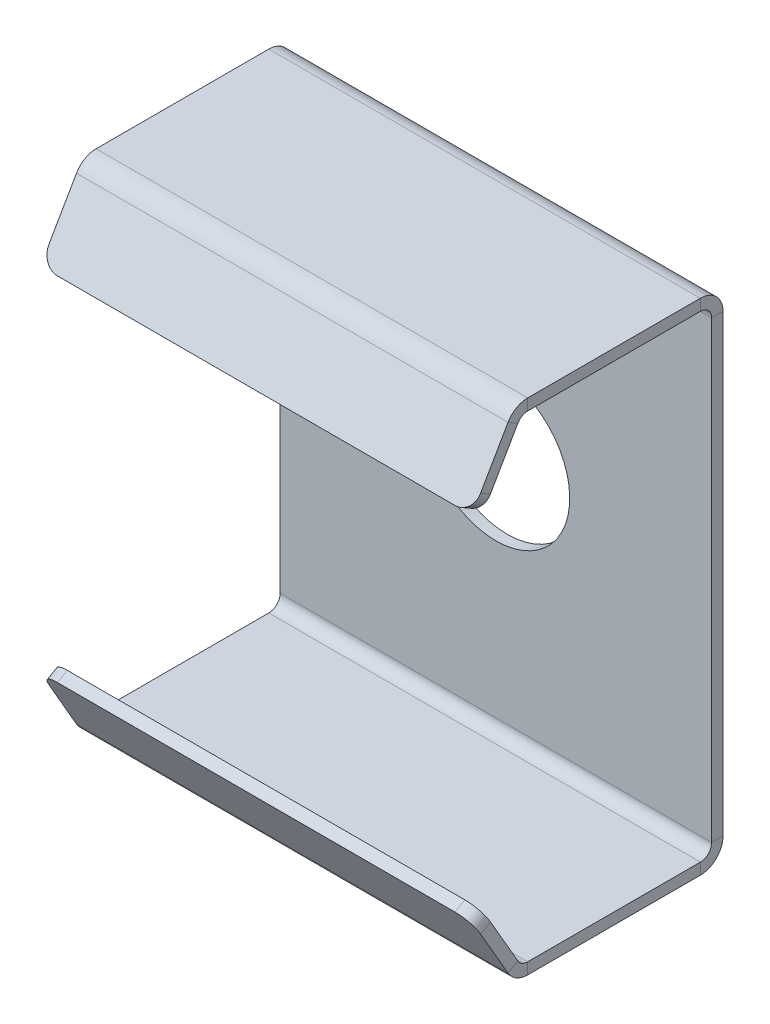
ISO-10303-21;
HEADER;
FILE_DESCRIPTION(('STEP AP214'),'2;1');
FILE_NAME('part.step','',(''),(''),'','','');
FILE_SCHEMA(('AUTOMOTIVE_DESIGN { 1 0 10303 214 1 1 1 1 }'));
ENDSEC;
DATA;
#1=APPLICATION_CONTEXT('core data for automotive mechanical design processes');
#2=APPLICATION_PROTOCOL_DEFINITION('international standard','automotive_design',2000,#1);
#3=PRODUCT_CONTEXT('',#1,'mechanical');
#4=PRODUCT('Part','Part','',(#3));
#5=PRODUCT_RELATED_PRODUCT_CATEGORY('part','',(#4));
#6=PRODUCT_DEFINITION_FORMATION('','',#4);
#7=PRODUCT_DEFINITION_CONTEXT('part definition',#1,'design');
#8=PRODUCT_DEFINITION('design','',#6,#7);
#9=PRODUCT_DEFINITION_SHAPE('','',#8);
#10=(LENGTH_UNIT() NAMED_UNIT(*) SI_UNIT(.MILLI.,.METRE.));
#11=(NAMED_UNIT(*) PLANE_ANGLE_UNIT() SI_UNIT($,.RADIAN.));
#12=(NAMED_UNIT(*) SI_UNIT($,.STERADIAN.) SOLID_ANGLE_UNIT());
#13=UNCERTAINTY_MEASURE_WITH_UNIT(LENGTH_MEASURE(1.E-05),#10,'distance_accuracy_value','');
#14=(GEOMETRIC_REPRESENTATION_CONTEXT(3) GLOBAL_UNCERTAINTY_ASSIGNED_CONTEXT((#13)) GLOBAL_UNIT_ASSIGNED_CONTEXT((#10,
#11,#12)) REPRESENTATION_CONTEXT('',''));
#15=CARTESIAN_POINT('',(0.,0.,0.));
#16=DIRECTION('',(0.,0.,1.));
#17=DIRECTION('',(1.,0.,0.));
#18=AXIS2_PLACEMENT_3D('',#15,#16,#17);
#19=CARTESIAN_POINT('',(17.5,-16.3038475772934,20.4886751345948));
#20=DIRECTION('',(0.,-0.5,0.866025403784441));
#21=DIRECTION('',(0.707106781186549,0.612372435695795,0.35355339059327));
#22=AXIS2_PLACEMENT_3D('',#19,#20,#21);
#23=CYLINDRICAL_SURFACE('',#22,1.5);
#24=CARTESIAN_POINT('',(17.5,-16.8038475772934,21.3547005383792));
#25=DIRECTION('',(0.,0.5,-0.86602540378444));
#26=DIRECTION('',(0.707106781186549,0.612372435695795,0.35355339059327));
#27=AXIS2_PLACEMENT_3D('',#24,#25,#26);
#28=CIRCLE('',#27,1.5);
#29=CARTESIAN_POINT('',(17.5,-15.5048094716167,22.1047005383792));
#30=VERTEX_POINT('',#29);
#31=CARTESIAN_POINT('',(19.,-16.8038475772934,21.3547005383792));
#32=VERTEX_POINT('',#31);
#33=EDGE_CURVE('E9',#30,#32,#28,.T.);
#34=ORIENTED_EDGE('',*,*,#33,.T.);
#35=DIRECTION('',(0.,0.5,-0.866025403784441));
#36=VECTOR('',#35,1.);
#37=CARTESIAN_POINT('',(19.,-16.3038475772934,20.4886751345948));
#38=LINE('',#37,#36);
#39=CARTESIAN_POINT('',(19.,-16.3038475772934,20.4886751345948));
#40=VERTEX_POINT('',#39);
#41=EDGE_CURVE('E25',#32,#40,#38,.T.);
#42=ORIENTED_EDGE('',*,*,#41,.T.);
#43=CARTESIAN_POINT('',(17.5,-16.3038475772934,20.4886751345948));
#44=DIRECTION('',(0.,-0.5,0.86602540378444));
#45=DIRECTION('',(0.707106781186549,0.612372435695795,0.35355339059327));
#46=AXIS2_PLACEMENT_3D('',#43,#44,#45);
#47=CIRCLE('',#46,1.5);
#48=CARTESIAN_POINT('',(17.5,-15.0048094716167,21.2386751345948));
#49=VERTEX_POINT('',#48);
#50=EDGE_CURVE('E280',#40,#49,#47,.T.);
#51=ORIENTED_EDGE('',*,*,#50,.T.);
#52=DIRECTION('',(0.,-0.5,0.866025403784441));
#53=VECTOR('',#52,1.);
#54=CARTESIAN_POINT('',(17.5,-15.0048094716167,21.2386751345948));
#55=LINE('',#54,#53);
#56=EDGE_CURVE('E18',#49,#30,#55,.T.);
#57=ORIENTED_EDGE('',*,*,#56,.T.);
#58=EDGE_LOOP('',(#34,#42,#51,#57));
#59=FACE_BOUND('',#58,.T.);
#60=ADVANCED_FACE('F14',(#59),#23,.T.);
#61=CARTESIAN_POINT('',(-19.,-15.0048094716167,21.2386751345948));
#62=DIRECTION('',(0.,0.866025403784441,0.5));
#63=DIRECTION('',(1.,0.,0.));
#64=AXIS2_PLACEMENT_3D('',#61,#62,#63);
#65=PLANE('',#64);
#66=ORIENTED_EDGE('',*,*,#56,.F.);
#67=DIRECTION('',(1.,0.,0.));
#68=VECTOR('',#67,1.);
#69=CARTESIAN_POINT('',(-19.,-15.0048094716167,21.2386751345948));
#70=LINE('',#69,#68);
#71=CARTESIAN_POINT('',(-17.5,-15.0048094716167,21.2386751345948));
#72=VERTEX_POINT('',#71);
#73=EDGE_CURVE('E428',#72,#49,#70,.T.);
#74=ORIENTED_EDGE('',*,*,#73,.F.);
#75=DIRECTION('',(0.,0.5,-0.866025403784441));
#76=VECTOR('',#75,1.);
#77=CARTESIAN_POINT('',(-17.5,-15.0048094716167,21.2386751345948));
#78=LINE('',#77,#76);
#79=CARTESIAN_POINT('',(-17.5,-15.5048094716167,22.1047005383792));
#80=VERTEX_POINT('',#79);
#81=EDGE_CURVE('E267',#80,#72,#78,.T.);
#82=ORIENTED_EDGE('',*,*,#81,.F.);
#83=DIRECTION('',(1.,0.,0.));
#84=VECTOR('',#83,1.);
#85=CARTESIAN_POINT('',(-19.,-15.5048094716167,22.1047005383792));
#86=LINE('',#85,#84);
#87=EDGE_CURVE('E388',#80,#30,#86,.T.);
#88=ORIENTED_EDGE('',*,*,#87,.T.);
#89=EDGE_LOOP('',(#66,#74,#82,#88));
#90=FACE_BOUND('',#89,.T.);
#91=ADVANCED_FACE('F709',(#90),#65,.T.);
#92=CARTESIAN_POINT('',(0.,-18.4053725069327,19.2753591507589));
#93=DIRECTION('',(0.,-0.5,0.86602540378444));
#94=DIRECTION('',(-1.,0.,0.));
#95=AXIS2_PLACEMENT_3D('',#92,#93,#94);
#96=PLANE('',#95);
#97=ORIENTED_EDGE('',*,*,#50,.F.);
#98=DIRECTION('',(0.,-0.866025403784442,-0.499999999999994));
#99=VECTOR('',#98,1.);
#100=CARTESIAN_POINT('',(19.,-24.4178066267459,15.8040786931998));
#101=LINE('',#100,#99);
#102=CARTESIAN_POINT('',(19.,-20.5,18.0660254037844));
#103=VERTEX_POINT('',#102);
#104=EDGE_CURVE('E232',#40,#103,#101,.T.);
#105=ORIENTED_EDGE('',*,*,#104,.T.);
#106=DIRECTION('',(-1.,0.,0.));
#107=VECTOR('',#106,1.);
#108=CARTESIAN_POINT('',(0.,-20.5,18.0660254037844));
#109=LINE('',#108,#107);
#110=CARTESIAN_POINT('',(-19.,-20.5,18.0660254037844));
#111=VERTEX_POINT('',#110);
#112=EDGE_CURVE('E424',#103,#111,#109,.T.);
#113=ORIENTED_EDGE('',*,*,#112,.T.);
#114=DIRECTION('',(0.,-0.866025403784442,-0.499999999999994));
#115=VECTOR('',#114,1.);
#116=CARTESIAN_POINT('',(-19.,-24.4178066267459,15.8040786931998));
#117=LINE('',#116,#115);
#118=CARTESIAN_POINT('',(-19.,-16.3038475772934,20.4886751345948));
#119=VERTEX_POINT('',#118);
#120=EDGE_CURVE('E582',#119,#111,#117,.T.);
#121=ORIENTED_EDGE('',*,*,#120,.F.);
#122=CARTESIAN_POINT('',(-17.5,-16.3038475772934,20.4886751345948));
#123=DIRECTION('',(0.,-0.5,0.866025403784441));
#124=DIRECTION('',(-0.707106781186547,0.612372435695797,0.35355339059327));
#125=AXIS2_PLACEMENT_3D('',#122,#123,#124);
#126=CIRCLE('',#125,1.5);
#127=EDGE_CURVE('E263',#72,#119,#126,.T.);
#128=ORIENTED_EDGE('',*,*,#127,.F.);
#129=ORIENTED_EDGE('',*,*,#73,.T.);
#130=EDGE_LOOP('',(#97,#105,#113,#121,#128,#129));
#131=FACE_BOUND('',#130,.T.);
#132=ADVANCED_FACE('F493',(#131),#96,.F.);
#133=CARTESIAN_POINT('',(-17.5,-16.3038475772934,20.4886751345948));
#134=DIRECTION('',(0.,-0.5,0.866025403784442));
#135=DIRECTION('',(-0.707106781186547,0.612372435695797,0.35355339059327));
#136=AXIS2_PLACEMENT_3D('',#133,#134,#135);
#137=CYLINDRICAL_SURFACE('',#136,1.5);
#138=CARTESIAN_POINT('',(-17.5,-16.8038475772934,21.3547005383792));
#139=DIRECTION('',(0.,0.5,-0.866025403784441));
#140=DIRECTION('',(-0.707106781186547,0.612372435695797,0.35355339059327));
#141=AXIS2_PLACEMENT_3D('',#138,#139,#140);
#142=CIRCLE('',#141,1.5);
#143=CARTESIAN_POINT('',(-19.,-16.8038475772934,21.3547005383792));
#144=VERTEX_POINT('',#143);
#145=EDGE_CURVE('E477',#144,#80,#142,.T.);
#146=ORIENTED_EDGE('',*,*,#145,.T.);
#147=ORIENTED_EDGE('',*,*,#81,.T.);
#148=ORIENTED_EDGE('',*,*,#127,.T.);
#149=DIRECTION('',(0.,-0.5,0.866025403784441));
#150=VECTOR('',#149,1.);
#151=CARTESIAN_POINT('',(-19.,-16.3038475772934,20.4886751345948));
#152=LINE('',#151,#150);
#153=EDGE_CURVE('E268',#119,#144,#152,.T.);
#154=ORIENTED_EDGE('',*,*,#153,.T.);
#155=EDGE_LOOP('',(#146,#147,#148,#154));
#156=FACE_BOUND('',#155,.T.);
#157=ADVANCED_FACE('F685',(#156),#137,.T.);
#158=CARTESIAN_POINT('',(-19.,-20.5,18.0660254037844));
#159=DIRECTION('',(-1.,0.,0.));
#160=DIRECTION('',(0.,1.,0.));
#161=AXIS2_PLACEMENT_3D('',#158,#159,#160);
#162=PLANE('',#161);
#163=ORIENTED_EDGE('',*,*,#153,.F.);
#164=ORIENTED_EDGE('',*,*,#120,.T.);
#165=DIRECTION('',(0.,-0.5,0.86602540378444));
#166=VECTOR('',#165,1.);
#167=CARTESIAN_POINT('',(-19.,-20.61,18.256550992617));
#168=LINE('',#167,#166);
#169=CARTESIAN_POINT('',(-19.,-21.,18.9320508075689));
#170=VERTEX_POINT('',#169);
#171=EDGE_CURVE('E463',#111,#170,#168,.T.);
#172=ORIENTED_EDGE('',*,*,#171,.T.);
#173=DIRECTION('',(0.,0.86602540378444,0.5));
#174=VECTOR('',#173,1.);
#175=CARTESIAN_POINT('',(-19.,-21.,18.9320508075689));
#176=LINE('',#175,#174);
#177=EDGE_CURVE('E192',#170,#144,#176,.T.);
#178=ORIENTED_EDGE('',*,*,#177,.T.);
#179=EDGE_LOOP('',(#163,#164,#172,#178));
#180=FACE_BOUND('',#179,.T.);
#181=ADVANCED_FACE('F690',(#180),#162,.T.);
#182=CARTESIAN_POINT('',(17.5,16.3038475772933,20.4886751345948));
#183=DIRECTION('',(0.,0.5,0.866025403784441));
#184=DIRECTION('',(0.707106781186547,-0.612372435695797,0.35355339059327));
#185=AXIS2_PLACEMENT_3D('',#182,#183,#184);
#186=CYLINDRICAL_SURFACE('',#185,1.5);
#187=CARTESIAN_POINT('',(17.5,16.8038475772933,21.3547005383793));
#188=DIRECTION('',(0.,-0.5,-0.866025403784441));
#189=DIRECTION('',(0.707106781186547,-0.612372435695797,0.35355339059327));
#190=AXIS2_PLACEMENT_3D('',#187,#188,#189);
#191=CIRCLE('',#190,1.5);
#192=CARTESIAN_POINT('',(19.,16.8038475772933,21.3547005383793));
#193=VERTEX_POINT('',#192);
#194=CARTESIAN_POINT('',(17.5,15.5048094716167,22.1047005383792));
#195=VERTEX_POINT('',#194);
#196=EDGE_CURVE('E392',#193,#195,#191,.T.);
#197=ORIENTED_EDGE('',*,*,#196,.T.);
#198=DIRECTION('',(0.,-0.5,-0.86602540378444));
#199=VECTOR('',#198,1.);
#200=CARTESIAN_POINT('',(17.5,15.0048094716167,21.2386751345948));
#201=LINE('',#200,#199);
#202=CARTESIAN_POINT('',(17.5,15.0048094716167,21.2386751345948));
#203=VERTEX_POINT('',#202);
#204=EDGE_CURVE('E395',#195,#203,#201,.T.);
#205=ORIENTED_EDGE('',*,*,#204,.T.);
#206=CARTESIAN_POINT('',(17.5,16.3038475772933,20.4886751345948));
#207=DIRECTION('',(0.,0.5,0.866025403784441));
#208=DIRECTION('',(0.707106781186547,-0.612372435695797,0.35355339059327));
#209=AXIS2_PLACEMENT_3D('',#206,#207,#208);
#210=CIRCLE('',#209,1.5);
#211=CARTESIAN_POINT('',(19.,16.3038475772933,20.4886751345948));
#212=VERTEX_POINT('',#211);
#213=EDGE_CURVE('E446',#203,#212,#210,.T.);
#214=ORIENTED_EDGE('',*,*,#213,.T.);
#215=DIRECTION('',(0.,0.5,0.86602540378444));
#216=VECTOR('',#215,1.);
#217=CARTESIAN_POINT('',(19.,16.3038475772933,20.4886751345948));
#218=LINE('',#217,#216);
#219=EDGE_CURVE('E77',#212,#193,#218,.T.);
#220=ORIENTED_EDGE('',*,*,#219,.T.);
#221=EDGE_LOOP('',(#197,#205,#214,#220));
#222=FACE_BOUND('',#221,.T.);
#223=ADVANCED_FACE('F777',(#222),#186,.T.);
#224=CARTESIAN_POINT('',(19.,20.5,18.0660254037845));
#225=DIRECTION('',(1.,0.,0.));
#226=DIRECTION('',(0.,-1.,0.));
#227=AXIS2_PLACEMENT_3D('',#224,#225,#226);
#228=PLANE('',#227);
#229=ORIENTED_EDGE('',*,*,#219,.F.);
#230=DIRECTION('',(0.,0.866025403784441,-0.5));
#231=VECTOR('',#230,1.);
#232=CARTESIAN_POINT('',(19.,24.4178066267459,15.8040786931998));
#233=LINE('',#232,#231);
#234=CARTESIAN_POINT('',(19.,20.5,18.0660254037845));
#235=VERTEX_POINT('',#234);
#236=EDGE_CURVE('E309',#212,#235,#233,.T.);
#237=ORIENTED_EDGE('',*,*,#236,.T.);
#238=DIRECTION('',(0.,0.5,0.866025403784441));
#239=VECTOR('',#238,1.);
#240=CARTESIAN_POINT('',(19.,20.61,18.256550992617));
#241=LINE('',#240,#239);
#242=CARTESIAN_POINT('',(19.,21.,18.9320508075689));
#243=VERTEX_POINT('',#242);
#244=EDGE_CURVE('E312',#235,#243,#241,.T.);
#245=ORIENTED_EDGE('',*,*,#244,.T.);
#246=DIRECTION('',(0.,-0.866025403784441,0.5));
#247=VECTOR('',#246,1.);
#248=CARTESIAN_POINT('',(19.,21.,18.9320508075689));
#249=LINE('',#248,#247);
#250=EDGE_CURVE('E358',#243,#193,#249,.T.);
#251=ORIENTED_EDGE('',*,*,#250,.T.);
#252=EDGE_LOOP('',(#229,#237,#245,#251));
#253=FACE_BOUND('',#252,.T.);
#254=ADVANCED_FACE('F753',(#253),#228,.T.);
#255=CARTESIAN_POINT('',(0.,18.4053725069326,19.2753591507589));
#256=DIRECTION('',(0.,-0.5,-0.866025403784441));
#257=DIRECTION('',(-1.,0.,0.));
#258=AXIS2_PLACEMENT_3D('',#255,#256,#257);
#259=PLANE('',#258);
#260=ORIENTED_EDGE('',*,*,#213,.F.);
#261=DIRECTION('',(-1.,0.,0.));
#262=VECTOR('',#261,1.);
#263=CARTESIAN_POINT('',(19.,15.0048094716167,21.2386751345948));
#264=LINE('',#263,#262);
#265=CARTESIAN_POINT('',(-17.5,15.0048094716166,21.2386751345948));
#266=VERTEX_POINT('',#265);
#267=EDGE_CURVE('E371',#203,#266,#264,.T.);
#268=ORIENTED_EDGE('',*,*,#267,.T.);
#269=CARTESIAN_POINT('',(-17.5,16.3038475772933,20.4886751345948));
#270=DIRECTION('',(0.,0.5,0.866025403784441));
#271=DIRECTION('',(-0.707106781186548,-0.612372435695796,0.353553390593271));
#272=AXIS2_PLACEMENT_3D('',#269,#270,#271);
#273=CIRCLE('',#272,1.5);
#274=CARTESIAN_POINT('',(-19.,16.3038475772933,20.4886751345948));
#275=VERTEX_POINT('',#274);
#276=EDGE_CURVE('E313',#275,#266,#273,.T.);
#277=ORIENTED_EDGE('',*,*,#276,.F.);
#278=DIRECTION('',(0.,0.866025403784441,-0.5));
#279=VECTOR('',#278,1.);
#280=CARTESIAN_POINT('',(-19.,24.4178066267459,15.8040786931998));
#281=LINE('',#280,#279);
#282=CARTESIAN_POINT('',(-19.,20.5,18.0660254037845));
#283=VERTEX_POINT('',#282);
#284=EDGE_CURVE('E326',#275,#283,#281,.T.);
#285=ORIENTED_EDGE('',*,*,#284,.T.);
#286=DIRECTION('',(1.,0.,0.));
#287=VECTOR('',#286,1.);
#288=CARTESIAN_POINT('',(0.,20.5,18.0660254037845));
#289=LINE('',#288,#287);
#290=EDGE_CURVE('E323',#283,#235,#289,.T.);
#291=ORIENTED_EDGE('',*,*,#290,.T.);
#292=ORIENTED_EDGE('',*,*,#236,.F.);
#293=EDGE_LOOP('',(#260,#268,#277,#285,#291,#292));
#294=FACE_BOUND('',#293,.T.);
#295=ADVANCED_FACE('F573',(#294),#259,.T.);
#296=CARTESIAN_POINT('',(-17.5,16.3038475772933,20.4886751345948));
#297=DIRECTION('',(0.,0.5,0.86602540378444));
#298=DIRECTION('',(-0.707106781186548,-0.612372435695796,0.353553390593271));
#299=AXIS2_PLACEMENT_3D('',#296,#297,#298);
#300=CYLINDRICAL_SURFACE('',#299,1.5);
#301=CARTESIAN_POINT('',(-17.5,16.8038475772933,21.3547005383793));
#302=DIRECTION('',(0.,-0.5,-0.866025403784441));
#303=DIRECTION('',(-0.707106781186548,-0.612372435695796,0.353553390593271));
#304=AXIS2_PLACEMENT_3D('',#301,#302,#303);
#305=CIRCLE('',#304,1.5);
#306=CARTESIAN_POINT('',(-17.5,15.5048094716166,22.1047005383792));
#307=VERTEX_POINT('',#306);
#308=CARTESIAN_POINT('',(-19.,16.8038475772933,21.3547005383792));
#309=VERTEX_POINT('',#308);
#310=EDGE_CURVE('E327',#307,#309,#305,.T.);
#311=ORIENTED_EDGE('',*,*,#310,.T.);
#312=DIRECTION('',(0.,-0.5,-0.86602540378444));
#313=VECTOR('',#312,1.);
#314=CARTESIAN_POINT('',(-19.,16.3038475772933,20.4886751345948));
#315=LINE('',#314,#313);
#316=EDGE_CURVE('E317',#309,#275,#315,.T.);
#317=ORIENTED_EDGE('',*,*,#316,.T.);
#318=ORIENTED_EDGE('',*,*,#276,.T.);
#319=DIRECTION('',(0.,0.5,0.86602540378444));
#320=VECTOR('',#319,1.);
#321=CARTESIAN_POINT('',(-17.5,15.0048094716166,21.2386751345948));
#322=LINE('',#321,#320);
#323=EDGE_CURVE('E318',#266,#307,#322,.T.);
#324=ORIENTED_EDGE('',*,*,#323,.T.);
#325=EDGE_LOOP('',(#311,#317,#318,#324));
#326=FACE_BOUND('',#325,.T.);
#327=ADVANCED_FACE('F575',(#326),#300,.T.);
#328=CARTESIAN_POINT('',(-19.,20.5,18.0660254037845));
#329=DIRECTION('',(-1.,0.,0.));
#330=DIRECTION('',(0.,0.,-1.));
#331=AXIS2_PLACEMENT_3D('',#328,#329,#330);
#332=PLANE('',#331);
#333=ORIENTED_EDGE('',*,*,#316,.F.);
#334=DIRECTION('',(0.,0.866025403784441,-0.5));
#335=VECTOR('',#334,1.);
#336=CARTESIAN_POINT('',(-19.,24.9178066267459,16.6701040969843));
#337=LINE('',#336,#335);
#338=CARTESIAN_POINT('',(-19.,21.,18.9320508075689));
#339=VERTEX_POINT('',#338);
#340=EDGE_CURVE('E247',#309,#339,#337,.T.);
#341=ORIENTED_EDGE('',*,*,#340,.T.);
#342=DIRECTION('',(0.,-0.5,-0.866025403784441));
#343=VECTOR('',#342,1.);
#344=CARTESIAN_POINT('',(-19.,20.61,18.256550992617));
#345=LINE('',#344,#343);
#346=EDGE_CURVE('E244',#339,#283,#345,.T.);
#347=ORIENTED_EDGE('',*,*,#346,.T.);
#348=ORIENTED_EDGE('',*,*,#284,.F.);
#349=EDGE_LOOP('',(#333,#341,#347,#348));
#350=FACE_BOUND('',#349,.T.);
#351=ADVANCED_FACE('F551',(#350),#332,.T.);
#352=CARTESIAN_POINT('',(0.,-20.,17.2));
#353=DIRECTION('',(-1.,0.,0.));
#354=DIRECTION('',(0.,-1.,0.));
#355=AXIS2_PLACEMENT_3D('',#352,#353,#354);
#356=CYLINDRICAL_SURFACE('',#355,2.);
#357=DIRECTION('',(1.,0.,0.));
#358=VECTOR('',#357,1.);
#359=CARTESIAN_POINT('',(0.,-21.,18.9320508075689));
#360=LINE('',#359,#358);
#361=CARTESIAN_POINT('',(19.,-21.,18.9320508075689));
#362=VERTEX_POINT('',#361);
#363=EDGE_CURVE('E185',#170,#362,#360,.T.);
#364=ORIENTED_EDGE('',*,*,#363,.F.);
#365=CARTESIAN_POINT('',(-19.,-20.,17.2));
#366=DIRECTION('',(-1.,0.,0.));
#367=DIRECTION('',(0.,-1.,0.));
#368=AXIS2_PLACEMENT_3D('',#365,#366,#367);
#369=CIRCLE('',#368,2.);
#370=CARTESIAN_POINT('',(-19.,-22.,17.2));
#371=VERTEX_POINT('',#370);
#372=EDGE_CURVE('E210',#371,#170,#369,.T.);
#373=ORIENTED_EDGE('',*,*,#372,.F.);
#374=DIRECTION('',(1.,0.,0.));
#375=VECTOR('',#374,1.);
#376=CARTESIAN_POINT('',(-19.,-22.,17.2));
#377=LINE('',#376,#375);
#378=CARTESIAN_POINT('',(19.,-22.,17.2));
#379=VERTEX_POINT('',#378);
#380=EDGE_CURVE('E204',#371,#379,#377,.T.);
#381=ORIENTED_EDGE('',*,*,#380,.T.);
#382=CARTESIAN_POINT('',(19.,-20.,17.2));
#383=DIRECTION('',(1.,0.,0.));
#384=DIRECTION('',(0.,-0.5,0.866025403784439));
#385=AXIS2_PLACEMENT_3D('',#382,#383,#384);
#386=CIRCLE('',#385,2.);
#387=EDGE_CURVE('E197',#362,#379,#386,.T.);
#388=ORIENTED_EDGE('',*,*,#387,.F.);
#389=EDGE_LOOP('',(#364,#373,#381,#388));
#390=FACE_BOUND('',#389,.T.);
#391=ADVANCED_FACE('F202',(#390),#356,.T.);
#392=CARTESIAN_POINT('',(19.,-20.5,18.0660254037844));
#393=DIRECTION('',(1.,0.,0.));
#394=DIRECTION('',(0.,-1.,0.));
#395=AXIS2_PLACEMENT_3D('',#392,#393,#394);
#396=PLANE('',#395);
#397=ORIENTED_EDGE('',*,*,#41,.F.);
#398=DIRECTION('',(0.,-0.866025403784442,-0.499999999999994));
#399=VECTOR('',#398,1.);
#400=CARTESIAN_POINT('',(19.,-24.9178066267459,16.6701040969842));
#401=LINE('',#400,#399);
#402=EDGE_CURVE('E189',#32,#362,#401,.T.);
#403=ORIENTED_EDGE('',*,*,#402,.T.);
#404=DIRECTION('',(0.,0.5,-0.86602540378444));
#405=VECTOR('',#404,1.);
#406=CARTESIAN_POINT('',(19.,-20.61,18.256550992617));
#407=LINE('',#406,#405);
#408=EDGE_CURVE('E214',#362,#103,#407,.T.);
#409=ORIENTED_EDGE('',*,*,#408,.T.);
#410=ORIENTED_EDGE('',*,*,#104,.F.);
#411=EDGE_LOOP('',(#397,#403,#409,#410));
#412=FACE_BOUND('',#411,.T.);
#413=ADVANCED_FACE('F213',(#412),#396,.T.);
#414=CARTESIAN_POINT('',(-19.,-20.5,18.0660254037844));
#415=DIRECTION('',(-1.,0.,0.));
#416=DIRECTION('',(0.,1.,0.));
#417=AXIS2_PLACEMENT_3D('',#414,#415,#416);
#418=PLANE('',#417);
#419=ORIENTED_EDGE('',*,*,#171,.F.);
#420=CARTESIAN_POINT('',(-19.,-20.,17.2));
#421=DIRECTION('',(1.,0.,0.));
#422=DIRECTION('',(0.,-0.5,0.866025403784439));
#423=AXIS2_PLACEMENT_3D('',#420,#421,#422);
#424=CIRCLE('',#423,0.999999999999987);
#425=CARTESIAN_POINT('',(-19.,-21.,17.2));
#426=VERTEX_POINT('',#425);
#427=EDGE_CURVE('E221',#111,#426,#424,.T.);
#428=ORIENTED_EDGE('',*,*,#427,.T.);
#429=DIRECTION('',(0.,-1.,0.));
#430=VECTOR('',#429,1.);
#431=CARTESIAN_POINT('',(-19.,-21.,17.2));
#432=LINE('',#431,#430);
#433=EDGE_CURVE('E228',#426,#371,#432,.T.);
#434=ORIENTED_EDGE('',*,*,#433,.T.);
#435=ORIENTED_EDGE('',*,*,#372,.T.);
#436=EDGE_LOOP('',(#419,#428,#434,#435));
#437=FACE_BOUND('',#436,.T.);
#438=ADVANCED_FACE('F692',(#437),#418,.T.);
#439=CARTESIAN_POINT('',(19.,-21.,18.9320508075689));
#440=DIRECTION('',(1.,0.,0.));
#441=DIRECTION('',(0.,-1.,0.));
#442=AXIS2_PLACEMENT_3D('',#439,#440,#441);
#443=PLANE('',#442);
#444=ORIENTED_EDGE('',*,*,#408,.F.);
#445=ORIENTED_EDGE('',*,*,#387,.T.);
#446=DIRECTION('',(0.,-1.,0.));
#447=VECTOR('',#446,1.);
#448=CARTESIAN_POINT('',(19.,-21.,17.2));
#449=LINE('',#448,#447);
#450=CARTESIAN_POINT('',(19.,-21.,17.2));
#451=VERTEX_POINT('',#450);
#452=EDGE_CURVE('E234',#451,#379,#449,.T.);
#453=ORIENTED_EDGE('',*,*,#452,.F.);
#454=CARTESIAN_POINT('',(19.,-20.,17.2));
#455=DIRECTION('',(1.,0.,0.));
#456=DIRECTION('',(0.,-0.5,0.866025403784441));
#457=AXIS2_PLACEMENT_3D('',#454,#455,#456);
#458=CIRCLE('',#457,0.999999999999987);
#459=EDGE_CURVE('E198',#103,#451,#458,.T.);
#460=ORIENTED_EDGE('',*,*,#459,.F.);
#461=EDGE_LOOP('',(#444,#445,#453,#460));
#462=FACE_BOUND('',#461,.T.);
#463=ADVANCED_FACE('F16',(#462),#443,.T.);
#464=CARTESIAN_POINT('',(0.,-18.9053725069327,20.1413845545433));
#465=DIRECTION('',(0.,-0.5,0.86602540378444));
#466=DIRECTION('',(-1.,0.,0.));
#467=AXIS2_PLACEMENT_3D('',#464,#465,#466);
#468=PLANE('',#467);
#469=ORIENTED_EDGE('',*,*,#33,.F.);
#470=ORIENTED_EDGE('',*,*,#87,.F.);
#471=ORIENTED_EDGE('',*,*,#145,.F.);
#472=ORIENTED_EDGE('',*,*,#177,.F.);
#473=ORIENTED_EDGE('',*,*,#363,.T.);
#474=ORIENTED_EDGE('',*,*,#402,.F.);
#475=EDGE_LOOP('',(#469,#470,#471,#472,#473,#474));
#476=FACE_BOUND('',#475,.T.);
#477=ADVANCED_FACE('F188',(#476),#468,.T.);
#478=CARTESIAN_POINT('',(0.,-20.,17.2));
#479=DIRECTION('',(-1.,0.,0.));
#480=DIRECTION('',(0.,-1.,0.));
#481=AXIS2_PLACEMENT_3D('',#478,#479,#480);
#482=CYLINDRICAL_SURFACE('',#481,1.);
#483=ORIENTED_EDGE('',*,*,#112,.F.);
#484=ORIENTED_EDGE('',*,*,#459,.T.);
#485=DIRECTION('',(1.,0.,0.));
#486=VECTOR('',#485,1.);
#487=CARTESIAN_POINT('',(-19.,-21.,17.2));
#488=LINE('',#487,#486);
#489=EDGE_CURVE('E413',#426,#451,#488,.T.);
#490=ORIENTED_EDGE('',*,*,#489,.F.);
#491=ORIENTED_EDGE('',*,*,#427,.F.);
#492=EDGE_LOOP('',(#483,#484,#490,#491));
#493=FACE_BOUND('',#492,.T.);
#494=ADVANCED_FACE('F744',(#493),#482,.F.);
#495=CARTESIAN_POINT('',(0.,20.,17.2));
#496=DIRECTION('',(1.,0.,0.));
#497=DIRECTION('',(0.,1.,0.));
#498=AXIS2_PLACEMENT_3D('',#495,#496,#497);
#499=CYLINDRICAL_SURFACE('',#498,2.);
#500=DIRECTION('',(-1.,0.,0.));
#501=VECTOR('',#500,1.);
#502=CARTESIAN_POINT('',(0.,21.,18.9320508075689));
#503=LINE('',#502,#501);
#504=EDGE_CURVE('E274',#243,#339,#503,.T.);
#505=ORIENTED_EDGE('',*,*,#504,.F.);
#506=CARTESIAN_POINT('',(19.,20.,17.2));
#507=DIRECTION('',(1.,0.,0.));
#508=DIRECTION('',(0.,1.,0.));
#509=AXIS2_PLACEMENT_3D('',#506,#507,#508);
#510=CIRCLE('',#509,2.);
#511=CARTESIAN_POINT('',(19.,22.,17.2));
#512=VERTEX_POINT('',#511);
#513=EDGE_CURVE('E367',#512,#243,#510,.T.);
#514=ORIENTED_EDGE('',*,*,#513,.F.);
#515=DIRECTION('',(-1.,0.,0.));
#516=VECTOR('',#515,1.);
#517=CARTESIAN_POINT('',(19.,22.,17.2));
#518=LINE('',#517,#516);
#519=CARTESIAN_POINT('',(-19.,22.,17.2));
#520=VERTEX_POINT('',#519);
#521=EDGE_CURVE('E308',#512,#520,#518,.T.);
#522=ORIENTED_EDGE('',*,*,#521,.T.);
#523=CARTESIAN_POINT('',(-19.,20.,17.2));
#524=DIRECTION('',(-1.,0.,0.));
#525=DIRECTION('',(0.,0.5,0.866025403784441));
#526=AXIS2_PLACEMENT_3D('',#523,#524,#525);
#527=CIRCLE('',#526,2.);
#528=EDGE_CURVE('E273',#339,#520,#527,.T.);
#529=ORIENTED_EDGE('',*,*,#528,.F.);
#530=EDGE_LOOP('',(#505,#514,#522,#529));
#531=FACE_BOUND('',#530,.T.);
#532=ADVANCED_FACE('F555',(#531),#499,.T.);
#533=CARTESIAN_POINT('',(19.,20.5,18.0660254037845));
#534=DIRECTION('',(1.,0.,0.));
#535=DIRECTION('',(0.,-1.,0.));
#536=AXIS2_PLACEMENT_3D('',#533,#534,#535);
#537=PLANE('',#536);
#538=ORIENTED_EDGE('',*,*,#244,.F.);
#539=CARTESIAN_POINT('',(19.,20.,17.2));
#540=DIRECTION('',(-1.,0.,0.));
#541=DIRECTION('',(0.,0.5,0.86602540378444));
#542=AXIS2_PLACEMENT_3D('',#539,#540,#541);
#543=CIRCLE('',#542,1.);
#544=CARTESIAN_POINT('',(19.,21.,17.2));
#545=VERTEX_POINT('',#544);
#546=EDGE_CURVE('E354',#235,#545,#543,.T.);
#547=ORIENTED_EDGE('',*,*,#546,.T.);
#548=DIRECTION('',(0.,1.,0.));
#549=VECTOR('',#548,1.);
#550=CARTESIAN_POINT('',(19.,21.,17.2));
#551=LINE('',#550,#549);
#552=EDGE_CURVE('E363',#545,#512,#551,.T.);
#553=ORIENTED_EDGE('',*,*,#552,.T.);
#554=ORIENTED_EDGE('',*,*,#513,.T.);
#555=EDGE_LOOP('',(#538,#547,#553,#554));
#556=FACE_BOUND('',#555,.T.);
#557=ADVANCED_FACE('F727',(#556),#537,.T.);
#558=CARTESIAN_POINT('',(-19.,21.,18.9320508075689));
#559=DIRECTION('',(-1.,0.,0.));
#560=DIRECTION('',(0.,0.,-1.));
#561=AXIS2_PLACEMENT_3D('',#558,#559,#560);
#562=PLANE('',#561);
#563=ORIENTED_EDGE('',*,*,#346,.F.);
#564=ORIENTED_EDGE('',*,*,#528,.T.);
#565=DIRECTION('',(0.,1.,0.));
#566=VECTOR('',#565,1.);
#567=CARTESIAN_POINT('',(-19.,21.,17.2));
#568=LINE('',#567,#566);
#569=CARTESIAN_POINT('',(-19.,21.,17.2));
#570=VERTEX_POINT('',#569);
#571=EDGE_CURVE('E262',#570,#520,#568,.T.);
#572=ORIENTED_EDGE('',*,*,#571,.F.);
#573=CARTESIAN_POINT('',(-19.,20.,17.2));
#574=DIRECTION('',(-1.,0.,0.));
#575=DIRECTION('',(0.,0.5,0.86602540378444));
#576=AXIS2_PLACEMENT_3D('',#573,#574,#575);
#577=CIRCLE('',#576,1.);
#578=EDGE_CURVE('E362',#283,#570,#577,.T.);
#579=ORIENTED_EDGE('',*,*,#578,.F.);
#580=EDGE_LOOP('',(#563,#564,#572,#579));
#581=FACE_BOUND('',#580,.T.);
#582=ADVANCED_FACE('F547',(#581),#562,.T.);
#583=CARTESIAN_POINT('',(19.,15.0048094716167,21.2386751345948));
#584=DIRECTION('',(0.,-0.86602540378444,0.5));
#585=DIRECTION('',(-1.,0.,0.));
#586=AXIS2_PLACEMENT_3D('',#583,#584,#585);
#587=PLANE('',#586);
#588=ORIENTED_EDGE('',*,*,#204,.F.);
#589=DIRECTION('',(-1.,0.,0.));
#590=VECTOR('',#589,1.);
#591=CARTESIAN_POINT('',(19.,15.5048094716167,22.1047005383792));
#592=LINE('',#591,#590);
#593=EDGE_CURVE('E269',#195,#307,#592,.T.);
#594=ORIENTED_EDGE('',*,*,#593,.T.);
#595=ORIENTED_EDGE('',*,*,#323,.F.);
#596=ORIENTED_EDGE('',*,*,#267,.F.);
#597=EDGE_LOOP('',(#588,#594,#595,#596));
#598=FACE_BOUND('',#597,.T.);
#599=ADVANCED_FACE('F732',(#598),#587,.T.);
#600=CARTESIAN_POINT('',(0.,18.9053725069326,20.1413845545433));
#601=DIRECTION('',(0.,-0.5,-0.866025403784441));
#602=DIRECTION('',(-1.,0.,0.));
#603=AXIS2_PLACEMENT_3D('',#600,#601,#602);
#604=PLANE('',#603);
#605=ORIENTED_EDGE('',*,*,#196,.F.);
#606=ORIENTED_EDGE('',*,*,#250,.F.);
#607=ORIENTED_EDGE('',*,*,#504,.T.);
#608=ORIENTED_EDGE('',*,*,#340,.F.);
#609=ORIENTED_EDGE('',*,*,#310,.F.);
#610=ORIENTED_EDGE('',*,*,#593,.F.);
#611=EDGE_LOOP('',(#605,#606,#607,#608,#609,#610));
#612=FACE_BOUND('',#611,.T.);
#613=ADVANCED_FACE('F542',(#612),#604,.F.);
#614=CARTESIAN_POINT('',(0.,20.,17.2));
#615=DIRECTION('',(1.,0.,0.));
#616=DIRECTION('',(0.,1.,0.));
#617=AXIS2_PLACEMENT_3D('',#614,#615,#616);
#618=CYLINDRICAL_SURFACE('',#617,1.);
#619=ORIENTED_EDGE('',*,*,#290,.F.);
#620=ORIENTED_EDGE('',*,*,#578,.T.);
#621=DIRECTION('',(-1.,0.,0.));
#622=VECTOR('',#621,1.);
#623=CARTESIAN_POINT('',(19.,21.,17.2));
#624=LINE('',#623,#622);
#625=EDGE_CURVE('E287',#545,#570,#624,.T.);
#626=ORIENTED_EDGE('',*,*,#625,.F.);
#627=ORIENTED_EDGE('',*,*,#546,.F.);
#628=EDGE_LOOP('',(#619,#620,#626,#627));
#629=FACE_BOUND('',#628,.T.);
#630=ADVANCED_FACE('F568',(#629),#618,.F.);
#631=CARTESIAN_POINT('',(0.,-20.,2.));
#632=DIRECTION('',(-1.,0.,0.));
#633=DIRECTION('',(0.,0.,-1.));
#634=AXIS2_PLACEMENT_3D('',#631,#632,#633);
#635=CYLINDRICAL_SURFACE('',#634,2.);
#636=DIRECTION('',(1.,0.,0.));
#637=VECTOR('',#636,1.);
#638=CARTESIAN_POINT('',(0.,-22.,2.));
#639=LINE('',#638,#637);
#640=CARTESIAN_POINT('',(-19.,-22.,2.));
#641=VERTEX_POINT('',#640);
#642=CARTESIAN_POINT('',(19.,-22.,2.));
#643=VERTEX_POINT('',#642);
#644=EDGE_CURVE('E322',#641,#643,#639,.T.);
#645=ORIENTED_EDGE('',*,*,#644,.F.);
#646=CARTESIAN_POINT('',(-19.,-20.,2.));
#647=DIRECTION('',(-1.,0.,0.));
#648=DIRECTION('',(0.,0.,-1.));
#649=AXIS2_PLACEMENT_3D('',#646,#647,#648);
#650=CIRCLE('',#649,2.);
#651=CARTESIAN_POINT('',(-19.,-20.,0.));
#652=VERTEX_POINT('',#651);
#653=EDGE_CURVE('E420',#652,#641,#650,.T.);
#654=ORIENTED_EDGE('',*,*,#653,.F.);
#655=DIRECTION('',(1.,0.,0.));
#656=VECTOR('',#655,1.);
#657=CARTESIAN_POINT('',(-19.,-20.,0.));
#658=LINE('',#657,#656);
#659=CARTESIAN_POINT('',(19.,-20.,0.));
#660=VERTEX_POINT('',#659);
#661=EDGE_CURVE('E375',#652,#660,#658,.T.);
#662=ORIENTED_EDGE('',*,*,#661,.T.);
#663=CARTESIAN_POINT('',(19.,-20.,2.));
#664=DIRECTION('',(1.,0.,0.));
#665=DIRECTION('',(0.,-1.,0.));
#666=AXIS2_PLACEMENT_3D('',#663,#664,#665);
#667=CIRCLE('',#666,2.);
#668=EDGE_CURVE('E405',#643,#660,#667,.T.);
#669=ORIENTED_EDGE('',*,*,#668,.F.);
#670=EDGE_LOOP('',(#645,#654,#662,#669));
#671=FACE_BOUND('',#670,.T.);
#672=ADVANCED_FACE('F646',(#671),#635,.T.);
#673=CARTESIAN_POINT('',(19.,-21.,2.));
#674=DIRECTION('',(1.,0.,0.));
#675=DIRECTION('',(0.,-1.,0.));
#676=AXIS2_PLACEMENT_3D('',#673,#674,#675);
#677=PLANE('',#676);
#678=DIRECTION('',(0.,1.,0.));
#679=VECTOR('',#678,1.);
#680=CARTESIAN_POINT('',(19.,-21.22,2.));
#681=LINE('',#680,#679);
#682=CARTESIAN_POINT('',(19.,-21.,2.));
#683=VERTEX_POINT('',#682);
#684=EDGE_CURVE('E236',#643,#683,#681,.T.);
#685=ORIENTED_EDGE('',*,*,#684,.T.);
#686=DIRECTION('',(0.,0.,-1.));
#687=VECTOR('',#686,1.);
#688=CARTESIAN_POINT('',(19.,-21.,-2.52389342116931));
#689=LINE('',#688,#687);
#690=EDGE_CURVE('E410',#451,#683,#689,.T.);
#691=ORIENTED_EDGE('',*,*,#690,.F.);
#692=ORIENTED_EDGE('',*,*,#452,.T.);
#693=DIRECTION('',(0.,0.,-1.));
#694=VECTOR('',#693,1.);
#695=CARTESIAN_POINT('',(19.,-22.,-2.52389342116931));
#696=LINE('',#695,#694);
#697=EDGE_CURVE('E237',#379,#643,#696,.T.);
#698=ORIENTED_EDGE('',*,*,#697,.T.);
#699=EDGE_LOOP('',(#685,#691,#692,#698));
#700=FACE_BOUND('',#699,.T.);
#701=ADVANCED_FACE('F721',(#700),#677,.T.);
#702=CARTESIAN_POINT('',(0.,-21.,8.46902664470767));
#703=DIRECTION('',(0.,1.,0.));
#704=DIRECTION('',(1.,0.,0.));
#705=AXIS2_PLACEMENT_3D('',#702,#703,#704);
#706=PLANE('',#705);
#707=DIRECTION('',(-1.,0.,0.));
#708=VECTOR('',#707,1.);
#709=CARTESIAN_POINT('',(0.,-21.,2.));
#710=LINE('',#709,#708);
#711=CARTESIAN_POINT('',(-19.,-21.,2.));
#712=VERTEX_POINT('',#711);
#713=EDGE_CURVE('E251',#683,#712,#710,.T.);
#714=ORIENTED_EDGE('',*,*,#713,.T.);
#715=DIRECTION('',(0.,0.,-1.));
#716=VECTOR('',#715,1.);
#717=CARTESIAN_POINT('',(-19.,-21.,-2.5238934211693));
#718=LINE('',#717,#716);
#719=EDGE_CURVE('E330',#426,#712,#718,.T.);
#720=ORIENTED_EDGE('',*,*,#719,.F.);
#721=ORIENTED_EDGE('',*,*,#489,.T.);
#722=ORIENTED_EDGE('',*,*,#690,.T.);
#723=EDGE_LOOP('',(#714,#720,#721,#722));
#724=FACE_BOUND('',#723,.T.);
#725=ADVANCED_FACE('F696',(#724),#706,.T.);
#726=CARTESIAN_POINT('',(-19.,-21.,2.));
#727=DIRECTION('',(-1.,0.,0.));
#728=DIRECTION('',(0.,0.,-1.));
#729=AXIS2_PLACEMENT_3D('',#726,#727,#728);
#730=PLANE('',#729);
#731=DIRECTION('',(0.,-1.,0.));
#732=VECTOR('',#731,1.);
#733=CARTESIAN_POINT('',(-19.,-21.22,2.));
#734=LINE('',#733,#732);
#735=EDGE_CURVE('E406',#712,#641,#734,.T.);
#736=ORIENTED_EDGE('',*,*,#735,.F.);
#737=CARTESIAN_POINT('',(-19.,-20.,2.));
#738=DIRECTION('',(1.,0.,0.));
#739=DIRECTION('',(0.,-1.,0.));
#740=AXIS2_PLACEMENT_3D('',#737,#738,#739);
#741=CIRCLE('',#740,1.);
#742=CARTESIAN_POINT('',(-19.,-20.,1.));
#743=VERTEX_POINT('',#742);
#744=EDGE_CURVE('E414',#712,#743,#741,.T.);
#745=ORIENTED_EDGE('',*,*,#744,.T.);
#746=DIRECTION('',(0.,0.,1.));
#747=VECTOR('',#746,1.);
#748=CARTESIAN_POINT('',(-19.,-20.,0.));
#749=LINE('',#748,#747);
#750=EDGE_CURVE('E300',#652,#743,#749,.T.);
#751=ORIENTED_EDGE('',*,*,#750,.F.);
#752=ORIENTED_EDGE('',*,*,#653,.T.);
#753=EDGE_LOOP('',(#736,#745,#751,#752));
#754=FACE_BOUND('',#753,.T.);
#755=ADVANCED_FACE('F651',(#754),#730,.T.);
#756=CARTESIAN_POINT('',(19.,-22.,2.));
#757=DIRECTION('',(1.,0.,0.));
#758=DIRECTION('',(0.,-1.,0.));
#759=AXIS2_PLACEMENT_3D('',#756,#757,#758);
#760=PLANE('',#759);
#761=ORIENTED_EDGE('',*,*,#684,.F.);
#762=ORIENTED_EDGE('',*,*,#668,.T.);
#763=DIRECTION('',(0.,0.,1.));
#764=VECTOR('',#763,1.);
#765=CARTESIAN_POINT('',(19.,-20.,0.));
#766=LINE('',#765,#764);
#767=CARTESIAN_POINT('',(19.,-20.,1.));
#768=VERTEX_POINT('',#767);
#769=EDGE_CURVE('E401',#660,#768,#766,.T.);
#770=ORIENTED_EDGE('',*,*,#769,.T.);
#771=CARTESIAN_POINT('',(19.,-20.,2.));
#772=DIRECTION('',(1.,0.,0.));
#773=DIRECTION('',(0.,-1.,0.));
#774=AXIS2_PLACEMENT_3D('',#771,#772,#773);
#775=CIRCLE('',#774,1.);
#776=EDGE_CURVE('E242',#683,#768,#775,.T.);
#777=ORIENTED_EDGE('',*,*,#776,.F.);
#778=EDGE_LOOP('',(#761,#762,#770,#777));
#779=FACE_BOUND('',#778,.T.);
#780=ADVANCED_FACE('F642',(#779),#760,.T.);
#781=CARTESIAN_POINT('',(-19.,-21.,2.));
#782=DIRECTION('',(-1.,0.,0.));
#783=DIRECTION('',(0.,0.,-1.));
#784=AXIS2_PLACEMENT_3D('',#781,#782,#783);
#785=PLANE('',#784);
#786=ORIENTED_EDGE('',*,*,#735,.T.);
#787=DIRECTION('',(0.,0.,1.));
#788=VECTOR('',#787,1.);
#789=CARTESIAN_POINT('',(-19.,-22.,2.));
#790=LINE('',#789,#788);
#791=EDGE_CURVE('E590',#641,#371,#790,.T.);
#792=ORIENTED_EDGE('',*,*,#791,.T.);
#793=ORIENTED_EDGE('',*,*,#433,.F.);
#794=ORIENTED_EDGE('',*,*,#719,.T.);
#795=EDGE_LOOP('',(#786,#792,#793,#794));
#796=FACE_BOUND('',#795,.T.);
#797=ADVANCED_FACE('F697',(#796),#785,.T.);
#798=CARTESIAN_POINT('',(0.,-22.,8.46902664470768));
#799=DIRECTION('',(0.,1.,0.));
#800=DIRECTION('',(1.,0.,0.));
#801=AXIS2_PLACEMENT_3D('',#798,#799,#800);
#802=PLANE('',#801);
#803=ORIENTED_EDGE('',*,*,#644,.T.);
#804=ORIENTED_EDGE('',*,*,#697,.F.);
#805=ORIENTED_EDGE('',*,*,#380,.F.);
#806=ORIENTED_EDGE('',*,*,#791,.F.);
#807=EDGE_LOOP('',(#803,#804,#805,#806));
#808=FACE_BOUND('',#807,.T.);
#809=ADVANCED_FACE('F654',(#808),#802,.F.);
#810=CARTESIAN_POINT('',(0.,-20.,2.));
#811=DIRECTION('',(-1.,0.,0.));
#812=DIRECTION('',(0.,0.,-1.));
#813=AXIS2_PLACEMENT_3D('',#810,#811,#812);
#814=CYLINDRICAL_SURFACE('',#813,1.);
#815=ORIENTED_EDGE('',*,*,#713,.F.);
#816=ORIENTED_EDGE('',*,*,#776,.T.);
#817=DIRECTION('',(-1.,0.,0.));
#818=VECTOR('',#817,1.);
#819=CARTESIAN_POINT('',(-19.,-20.,1.));
#820=LINE('',#819,#818);
#821=EDGE_CURVE('E238',#768,#743,#820,.T.);
#822=ORIENTED_EDGE('',*,*,#821,.T.);
#823=ORIENTED_EDGE('',*,*,#744,.F.);
#824=EDGE_LOOP('',(#815,#816,#822,#823));
#825=FACE_BOUND('',#824,.T.);
#826=ADVANCED_FACE('F639',(#825),#814,.F.);
#827=CARTESIAN_POINT('',(0.,20.,2.));
#828=DIRECTION('',(1.,0.,0.));
#829=DIRECTION('',(0.,0.,-1.));
#830=AXIS2_PLACEMENT_3D('',#827,#828,#829);
#831=CYLINDRICAL_SURFACE('',#830,2.);
#832=DIRECTION('',(-1.,0.,0.));
#833=VECTOR('',#832,1.);
#834=CARTESIAN_POINT('',(0.,22.,2.));
#835=LINE('',#834,#833);
#836=CARTESIAN_POINT('',(19.,22.,2.));
#837=VERTEX_POINT('',#836);
#838=CARTESIAN_POINT('',(-19.,22.,2.));
#839=VERTEX_POINT('',#838);
#840=EDGE_CURVE('E292',#837,#839,#835,.T.);
#841=ORIENTED_EDGE('',*,*,#840,.F.);
#842=CARTESIAN_POINT('',(19.,20.,2.));
#843=DIRECTION('',(1.,0.,0.));
#844=DIRECTION('',(0.,0.,-1.));
#845=AXIS2_PLACEMENT_3D('',#842,#843,#844);
#846=CIRCLE('',#845,2.);
#847=CARTESIAN_POINT('',(19.,20.,0.));
#848=VERTEX_POINT('',#847);
#849=EDGE_CURVE('E256',#848,#837,#846,.T.);
#850=ORIENTED_EDGE('',*,*,#849,.F.);
#851=DIRECTION('',(-1.,0.,0.));
#852=VECTOR('',#851,1.);
#853=CARTESIAN_POINT('',(19.,20.,0.));
#854=LINE('',#853,#852);
#855=CARTESIAN_POINT('',(-19.,20.,0.));
#856=VERTEX_POINT('',#855);
#857=EDGE_CURVE('E243',#848,#856,#854,.T.);
#858=ORIENTED_EDGE('',*,*,#857,.T.);
#859=CARTESIAN_POINT('',(-19.,20.,2.));
#860=DIRECTION('',(-1.,0.,0.));
#861=DIRECTION('',(0.,1.,0.));
#862=AXIS2_PLACEMENT_3D('',#859,#860,#861);
#863=CIRCLE('',#862,2.);
#864=EDGE_CURVE('E252',#839,#856,#863,.T.);
#865=ORIENTED_EDGE('',*,*,#864,.F.);
#866=EDGE_LOOP('',(#841,#850,#858,#865));
#867=FACE_BOUND('',#866,.T.);
#868=ADVANCED_FACE('F614',(#867),#831,.T.);
#869=CARTESIAN_POINT('',(-19.,21.,2.));
#870=DIRECTION('',(-1.,0.,0.));
#871=DIRECTION('',(0.,0.,-1.));
#872=AXIS2_PLACEMENT_3D('',#869,#870,#871);
#873=PLANE('',#872);
#874=DIRECTION('',(0.,-1.,0.));
#875=VECTOR('',#874,1.);
#876=CARTESIAN_POINT('',(-19.,21.22,2.));
#877=LINE('',#876,#875);
#878=CARTESIAN_POINT('',(-19.,21.,2.));
#879=VERTEX_POINT('',#878);
#880=EDGE_CURVE('E258',#839,#879,#877,.T.);
#881=ORIENTED_EDGE('',*,*,#880,.T.);
#882=DIRECTION('',(0.,0.,-1.));
#883=VECTOR('',#882,1.);
#884=CARTESIAN_POINT('',(-19.,21.,-2.52389342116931));
#885=LINE('',#884,#883);
#886=EDGE_CURVE('E350',#570,#879,#885,.T.);
#887=ORIENTED_EDGE('',*,*,#886,.F.);
#888=ORIENTED_EDGE('',*,*,#571,.T.);
#889=DIRECTION('',(0.,0.,-1.));
#890=VECTOR('',#889,1.);
#891=CARTESIAN_POINT('',(-19.,22.,-2.52389342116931));
#892=LINE('',#891,#890);
#893=EDGE_CURVE('E275',#520,#839,#892,.T.);
#894=ORIENTED_EDGE('',*,*,#893,.T.);
#895=EDGE_LOOP('',(#881,#887,#888,#894));
#896=FACE_BOUND('',#895,.T.);
#897=ADVANCED_FACE('F563',(#896),#873,.T.);
#898=CARTESIAN_POINT('',(0.,21.,8.46902664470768));
#899=DIRECTION('',(0.,-1.,0.));
#900=DIRECTION('',(1.,0.,0.));
#901=AXIS2_PLACEMENT_3D('',#898,#899,#900);
#902=PLANE('',#901);
#903=DIRECTION('',(1.,0.,0.));
#904=VECTOR('',#903,1.);
#905=CARTESIAN_POINT('',(0.,21.,2.));
#906=LINE('',#905,#904);
#907=CARTESIAN_POINT('',(19.,21.,2.));
#908=VERTEX_POINT('',#907);
#909=EDGE_CURVE('E279',#879,#908,#906,.T.);
#910=ORIENTED_EDGE('',*,*,#909,.T.);
#911=DIRECTION('',(0.,0.,-1.));
#912=VECTOR('',#911,1.);
#913=CARTESIAN_POINT('',(19.,21.,-2.52389342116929));
#914=LINE('',#913,#912);
#915=EDGE_CURVE('E299',#545,#908,#914,.T.);
#916=ORIENTED_EDGE('',*,*,#915,.F.);
#917=ORIENTED_EDGE('',*,*,#625,.T.);
#918=ORIENTED_EDGE('',*,*,#886,.T.);
#919=EDGE_LOOP('',(#910,#916,#917,#918));
#920=FACE_BOUND('',#919,.T.);
#921=ADVANCED_FACE('F622',(#920),#902,.T.);
#922=CARTESIAN_POINT('',(19.,21.,2.));
#923=DIRECTION('',(1.,0.,0.));
#924=DIRECTION('',(0.,-1.,0.));
#925=AXIS2_PLACEMENT_3D('',#922,#923,#924);
#926=PLANE('',#925);
#927=DIRECTION('',(0.,1.,0.));
#928=VECTOR('',#927,1.);
#929=CARTESIAN_POINT('',(19.,21.22,2.));
#930=LINE('',#929,#928);
#931=EDGE_CURVE('E298',#908,#837,#930,.T.);
#932=ORIENTED_EDGE('',*,*,#931,.F.);
#933=CARTESIAN_POINT('',(19.,20.,2.));
#934=DIRECTION('',(-1.,0.,0.));
#935=DIRECTION('',(0.,1.,0.));
#936=AXIS2_PLACEMENT_3D('',#933,#934,#935);
#937=CIRCLE('',#936,1.);
#938=CARTESIAN_POINT('',(19.,20.,1.));
#939=VERTEX_POINT('',#938);
#940=EDGE_CURVE('E334',#908,#939,#937,.T.);
#941=ORIENTED_EDGE('',*,*,#940,.T.);
#942=DIRECTION('',(0.,0.,1.));
#943=VECTOR('',#942,1.);
#944=CARTESIAN_POINT('',(19.,20.,0.));
#945=LINE('',#944,#943);
#946=EDGE_CURVE('E337',#848,#939,#945,.T.);
#947=ORIENTED_EDGE('',*,*,#946,.F.);
#948=ORIENTED_EDGE('',*,*,#849,.T.);
#949=EDGE_LOOP('',(#932,#941,#947,#948));
#950=FACE_BOUND('',#949,.T.);
#951=ADVANCED_FACE('F617',(#950),#926,.T.);
#952=CARTESIAN_POINT('',(-19.,22.,2.));
#953=DIRECTION('',(-1.,0.,0.));
#954=DIRECTION('',(0.,0.,-1.));
#955=AXIS2_PLACEMENT_3D('',#952,#953,#954);
#956=PLANE('',#955);
#957=ORIENTED_EDGE('',*,*,#880,.F.);
#958=ORIENTED_EDGE('',*,*,#864,.T.);
#959=DIRECTION('',(0.,0.,1.));
#960=VECTOR('',#959,1.);
#961=CARTESIAN_POINT('',(-19.,20.,0.));
#962=LINE('',#961,#960);
#963=CARTESIAN_POINT('',(-19.,20.,1.));
#964=VERTEX_POINT('',#963);
#965=EDGE_CURVE('E257',#856,#964,#962,.T.);
#966=ORIENTED_EDGE('',*,*,#965,.T.);
#967=CARTESIAN_POINT('',(-19.,20.,2.));
#968=DIRECTION('',(-1.,0.,0.));
#969=DIRECTION('',(0.,1.,0.));
#970=AXIS2_PLACEMENT_3D('',#967,#968,#969);
#971=CIRCLE('',#970,1.);
#972=EDGE_CURVE('E288',#879,#964,#971,.T.);
#973=ORIENTED_EDGE('',*,*,#972,.F.);
#974=EDGE_LOOP('',(#957,#958,#966,#973));
#975=FACE_BOUND('',#974,.T.);
#976=ADVANCED_FACE('F724',(#975),#956,.T.);
#977=CARTESIAN_POINT('',(19.,21.,2.));
#978=DIRECTION('',(1.,0.,0.));
#979=DIRECTION('',(0.,-1.,0.));
#980=AXIS2_PLACEMENT_3D('',#977,#978,#979);
#981=PLANE('',#980);
#982=ORIENTED_EDGE('',*,*,#931,.T.);
#983=DIRECTION('',(0.,0.,1.));
#984=VECTOR('',#983,1.);
#985=CARTESIAN_POINT('',(19.,22.,2.));
#986=LINE('',#985,#984);
#987=EDGE_CURVE('E294',#837,#512,#986,.T.);
#988=ORIENTED_EDGE('',*,*,#987,.T.);
#989=ORIENTED_EDGE('',*,*,#552,.F.);
#990=ORIENTED_EDGE('',*,*,#915,.T.);
#991=EDGE_LOOP('',(#982,#988,#989,#990));
#992=FACE_BOUND('',#991,.T.);
#993=ADVANCED_FACE('F619',(#992),#981,.T.);
#994=CARTESIAN_POINT('',(0.,22.,8.46902664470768));
#995=DIRECTION('',(0.,-1.,0.));
#996=DIRECTION('',(1.,0.,0.));
#997=AXIS2_PLACEMENT_3D('',#994,#995,#996);
#998=PLANE('',#997);
#999=ORIENTED_EDGE('',*,*,#840,.T.);
#1000=ORIENTED_EDGE('',*,*,#893,.F.);
#1001=ORIENTED_EDGE('',*,*,#521,.F.);
#1002=ORIENTED_EDGE('',*,*,#987,.F.);
#1003=EDGE_LOOP('',(#999,#1000,#1001,#1002));
#1004=FACE_BOUND('',#1003,.T.);
#1005=ADVANCED_FACE('F560',(#1004),#998,.F.);
#1006=CARTESIAN_POINT('',(0.,20.,2.));
#1007=DIRECTION('',(1.,0.,0.));
#1008=DIRECTION('',(0.,0.,-1.));
#1009=AXIS2_PLACEMENT_3D('',#1006,#1007,#1008);
#1010=CYLINDRICAL_SURFACE('',#1009,1.);
#1011=ORIENTED_EDGE('',*,*,#909,.F.);
#1012=ORIENTED_EDGE('',*,*,#972,.T.);
#1013=DIRECTION('',(1.,0.,0.));
#1014=VECTOR('',#1013,1.);
#1015=CARTESIAN_POINT('',(19.,20.,1.));
#1016=LINE('',#1015,#1014);
#1017=EDGE_CURVE('E293',#964,#939,#1016,.T.);
#1018=ORIENTED_EDGE('',*,*,#1017,.T.);
#1019=ORIENTED_EDGE('',*,*,#940,.F.);
#1020=EDGE_LOOP('',(#1011,#1012,#1018,#1019));
#1021=FACE_BOUND('',#1020,.T.);
#1022=ADVANCED_FACE('F626',(#1021),#1010,.F.);
#1023=CARTESIAN_POINT('',(0.,0.,0.));
#1024=DIRECTION('',(0.,0.,1.));
#1025=DIRECTION('',(0.,1.,0.));
#1026=AXIS2_PLACEMENT_3D('',#1023,#1024,#1025);
#1027=CYLINDRICAL_SURFACE('',#1026,6.5);
#1028=CARTESIAN_POINT('',(0.,0.,1.));
#1029=DIRECTION('',(0.,0.,-1.));
#1030=DIRECTION('',(0.,1.,0.));
#1031=AXIS2_PLACEMENT_3D('',#1028,#1029,#1030);
#1032=CIRCLE('',#1031,6.5);
#1033=CARTESIAN_POINT('',(0.,-6.5,1.));
#1034=VERTEX_POINT('',#1033);
#1035=EDGE_CURVE('E481',#1034,#1034,#1032,.T.);
#1036=ORIENTED_EDGE('',*,*,#1035,.F.);
#1037=EDGE_LOOP('',(#1036));
#1038=FACE_BOUND('',#1037,.T.);
#1039=CARTESIAN_POINT('',(0.,0.,0.));
#1040=DIRECTION('',(0.,0.,1.));
#1041=DIRECTION('',(0.,1.,0.));
#1042=AXIS2_PLACEMENT_3D('',#1039,#1040,#1041);
#1043=CIRCLE('',#1042,6.5);
#1044=CARTESIAN_POINT('',(0.,-6.5,0.));
#1045=VERTEX_POINT('',#1044);
#1046=EDGE_CURVE('E305',#1045,#1045,#1043,.T.);
#1047=ORIENTED_EDGE('',*,*,#1046,.F.);
#1048=EDGE_LOOP('',(#1047));
#1049=FACE_BOUND('',#1048,.T.);
#1050=ADVANCED_FACE('F750',(#1038,#1049),#1027,.F.);
#1051=CARTESIAN_POINT('',(19.,20.,0.));
#1052=DIRECTION('',(1.,0.,0.));
#1053=DIRECTION('',(0.,-1.,0.));
#1054=AXIS2_PLACEMENT_3D('',#1051,#1052,#1053);
#1055=PLANE('',#1054);
#1056=DIRECTION('',(0.,-1.,0.));
#1057=VECTOR('',#1056,1.);
#1058=CARTESIAN_POINT('',(19.,-20.,1.));
#1059=LINE('',#1058,#1057);
#1060=EDGE_CURVE('E343',#939,#768,#1059,.T.);
#1061=ORIENTED_EDGE('',*,*,#1060,.T.);
#1062=ORIENTED_EDGE('',*,*,#769,.F.);
#1063=DIRECTION('',(0.,1.,0.));
#1064=VECTOR('',#1063,1.);
#1065=CARTESIAN_POINT('',(19.,-20.,0.));
#1066=LINE('',#1065,#1064);
#1067=EDGE_CURVE('E341',#660,#848,#1066,.T.);
#1068=ORIENTED_EDGE('',*,*,#1067,.T.);
#1069=ORIENTED_EDGE('',*,*,#946,.T.);
#1070=EDGE_LOOP('',(#1061,#1062,#1068,#1069));
#1071=FACE_BOUND('',#1070,.T.);
#1072=ADVANCED_FACE('F603',(#1071),#1055,.T.);
#1073=CARTESIAN_POINT('',(-19.,-20.,0.));
#1074=DIRECTION('',(-1.,0.,0.));
#1075=DIRECTION('',(0.,1.,0.));
#1076=AXIS2_PLACEMENT_3D('',#1073,#1074,#1075);
#1077=PLANE('',#1076);
#1078=DIRECTION('',(0.,1.,0.));
#1079=VECTOR('',#1078,1.);
#1080=CARTESIAN_POINT('',(-19.,20.,1.));
#1081=LINE('',#1080,#1079);
#1082=EDGE_CURVE('E342',#743,#964,#1081,.T.);
#1083=ORIENTED_EDGE('',*,*,#1082,.T.);
#1084=ORIENTED_EDGE('',*,*,#965,.F.);
#1085=DIRECTION('',(0.,-1.,0.));
#1086=VECTOR('',#1085,1.);
#1087=CARTESIAN_POINT('',(-19.,20.,0.));
#1088=LINE('',#1087,#1086);
#1089=EDGE_CURVE('E304',#856,#652,#1088,.T.);
#1090=ORIENTED_EDGE('',*,*,#1089,.T.);
#1091=ORIENTED_EDGE('',*,*,#750,.T.);
#1092=EDGE_LOOP('',(#1083,#1084,#1090,#1091));
#1093=FACE_BOUND('',#1092,.T.);
#1094=ADVANCED_FACE('F749',(#1093),#1077,.T.);
#1095=CARTESIAN_POINT('',(0.,0.,0.));
#1096=DIRECTION('',(0.,0.,1.));
#1097=DIRECTION('',(0.,-1.,0.));
#1098=AXIS2_PLACEMENT_3D('',#1095,#1096,#1097);
#1099=PLANE('',#1098);
#1100=ORIENTED_EDGE('',*,*,#1089,.F.);
#1101=ORIENTED_EDGE('',*,*,#857,.F.);
#1102=ORIENTED_EDGE('',*,*,#1067,.F.);
#1103=ORIENTED_EDGE('',*,*,#661,.F.);
#1104=EDGE_LOOP('',(#1100,#1101,#1102,#1103));
#1105=FACE_BOUND('',#1104,.T.);
#1106=ORIENTED_EDGE('',*,*,#1046,.T.);
#1107=EDGE_LOOP('',(#1106));
#1108=FACE_BOUND('',#1107,.T.);
#1109=ADVANCED_FACE('F610',(#1105,#1108),#1099,.F.);
#1110=CARTESIAN_POINT('',(0.,0.,1.));
#1111=DIRECTION('',(0.,0.,1.));
#1112=DIRECTION('',(0.,-1.,0.));
#1113=AXIS2_PLACEMENT_3D('',#1110,#1111,#1112);
#1114=PLANE('',#1113);
#1115=ORIENTED_EDGE('',*,*,#1017,.F.);
#1116=ORIENTED_EDGE('',*,*,#1082,.F.);
#1117=ORIENTED_EDGE('',*,*,#821,.F.);
#1118=ORIENTED_EDGE('',*,*,#1060,.F.);
#1119=EDGE_LOOP('',(#1115,#1116,#1117,#1118));
#1120=FACE_BOUND('',#1119,.T.);
#1121=ORIENTED_EDGE('',*,*,#1035,.T.);
#1122=EDGE_LOOP('',(#1121));
#1123=FACE_BOUND('',#1122,.T.);
#1124=ADVANCED_FACE('F632',(#1120,#1123),#1114,.T.);
#1125=CLOSED_SHELL('',(#60,#91,#132,#157,#181,#223,#254,#295,#327,#351,#391,#413,#438,#463,#477,
#494,#532,#557,#582,#599,#613,#630,#672,#701,#725,#755,#780,#797,#809,#826,#868,#897,#921,#951,
#976,#993,#1005,#1022,#1050,#1072,#1094,#1109,#1124));
#1126=MANIFOLD_SOLID_BREP('B1',#1125);
#1127=ADVANCED_BREP_SHAPE_REPRESENTATION('',(#18,#1126),#14);
#1128=SHAPE_DEFINITION_REPRESENTATION(#9,#1127);
ENDSEC;
END-ISO-10303-21;
